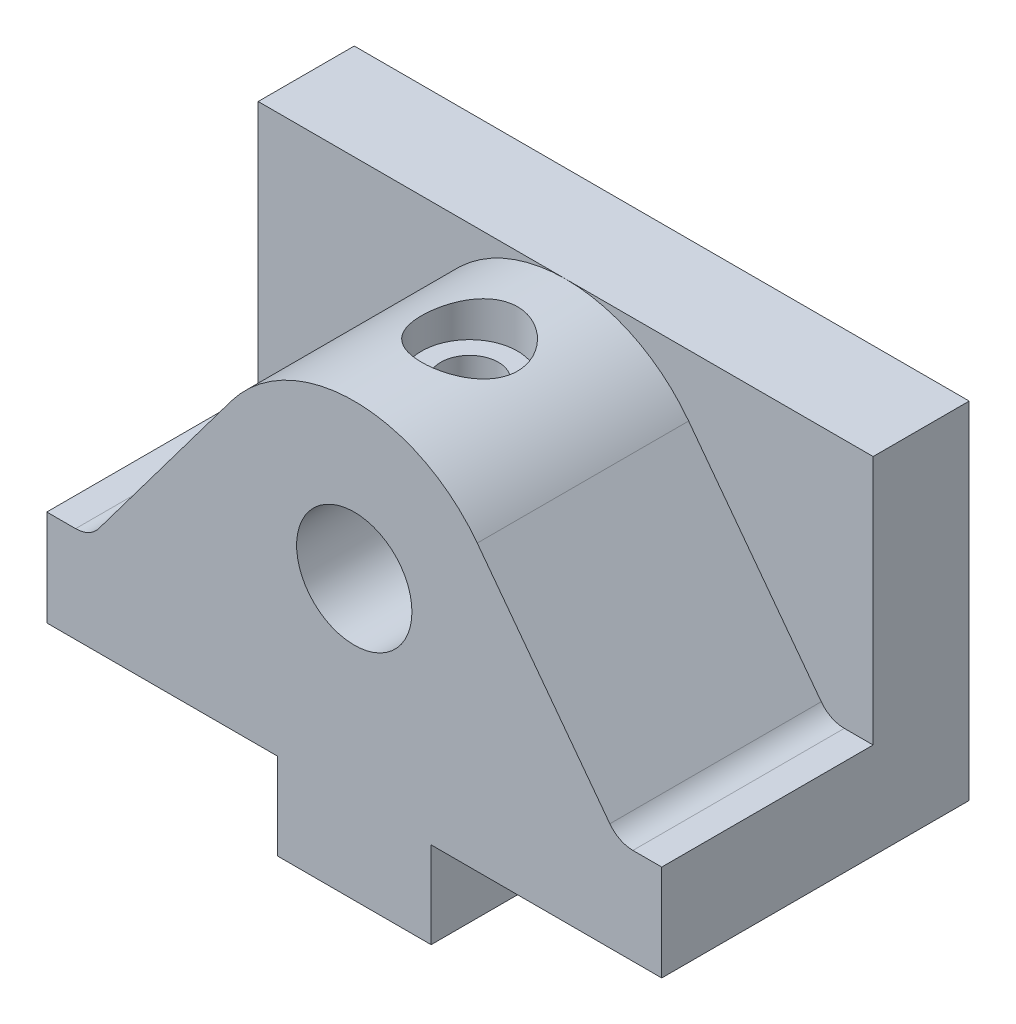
ISO-10303-21;
HEADER;
FILE_DESCRIPTION(('STEP AP214'),'2;1');
FILE_NAME('part.step','',(''),(''),'','','');
FILE_SCHEMA(('AUTOMOTIVE_DESIGN { 1 0 10303 214 1 1 1 1 }'));
ENDSEC;
DATA;
#1=APPLICATION_CONTEXT('core data for automotive mechanical design processes');
#2=APPLICATION_PROTOCOL_DEFINITION('international standard','automotive_design',2000,#1);
#3=PRODUCT_CONTEXT('',#1,'mechanical');
#4=PRODUCT('Part','Part','',(#3));
#5=PRODUCT_RELATED_PRODUCT_CATEGORY('part','',(#4));
#6=PRODUCT_DEFINITION_FORMATION('','',#4);
#7=PRODUCT_DEFINITION_CONTEXT('part definition',#1,'design');
#8=PRODUCT_DEFINITION('design','',#6,#7);
#9=PRODUCT_DEFINITION_SHAPE('','',#8);
#10=(LENGTH_UNIT() NAMED_UNIT(*) SI_UNIT(.MILLI.,.METRE.));
#11=(NAMED_UNIT(*) PLANE_ANGLE_UNIT() SI_UNIT($,.RADIAN.));
#12=(NAMED_UNIT(*) SI_UNIT($,.STERADIAN.) SOLID_ANGLE_UNIT());
#13=UNCERTAINTY_MEASURE_WITH_UNIT(LENGTH_MEASURE(1.E-05),#10,'distance_accuracy_value','');
#14=(GEOMETRIC_REPRESENTATION_CONTEXT(3) GLOBAL_UNCERTAINTY_ASSIGNED_CONTEXT((#13)) GLOBAL_UNIT_ASSIGNED_CONTEXT((#10,
#11,#12)) REPRESENTATION_CONTEXT('',''));
#15=CARTESIAN_POINT('',(0.,0.,0.));
#16=DIRECTION('',(0.,0.,1.));
#17=DIRECTION('',(1.,0.,0.));
#18=AXIS2_PLACEMENT_3D('',#15,#16,#17);
#19=CARTESIAN_POINT('',(8.00000000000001,-23.,32.));
#20=DIRECTION('',(0.,1.,0.));
#21=DIRECTION('',(-1.,0.,0.));
#22=AXIS2_PLACEMENT_3D('',#19,#20,#21);
#23=PLANE('',#22);
#24=CARTESIAN_POINT('',(0.,-23.,24.));
#25=DIRECTION('',(0.,1.,0.));
#26=DIRECTION('',(-1.,0.,0.));
#27=AXIS2_PLACEMENT_3D('',#24,#25,#26);
#28=CIRCLE('',#27,3.);
#29=CARTESIAN_POINT('',(-2.99999999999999,-23.,24.));
#30=VERTEX_POINT('',#29);
#31=EDGE_CURVE('E179',#30,#30,#28,.T.);
#32=ORIENTED_EDGE('',*,*,#31,.T.);
#33=EDGE_LOOP('',(#32));
#34=FACE_BOUND('',#33,.T.);
#35=DIRECTION('',(1.,0.,0.));
#36=VECTOR('',#35,1.);
#37=CARTESIAN_POINT('',(8.00000000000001,-23.,0.));
#38=LINE('',#37,#36);
#39=CARTESIAN_POINT('',(-7.99999999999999,-23.,0.));
#40=VERTEX_POINT('',#39);
#41=CARTESIAN_POINT('',(8.00000000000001,-23.,0.));
#42=VERTEX_POINT('',#41);
#43=EDGE_CURVE('E358',#40,#42,#38,.T.);
#44=ORIENTED_EDGE('',*,*,#43,.T.);
#45=DIRECTION('',(0.,0.,-1.));
#46=VECTOR('',#45,1.);
#47=CARTESIAN_POINT('',(8.00000000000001,-23.,32.));
#48=LINE('',#47,#46);
#49=CARTESIAN_POINT('',(8.00000000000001,-23.,32.));
#50=VERTEX_POINT('',#49);
#51=EDGE_CURVE('E385',#50,#42,#48,.T.);
#52=ORIENTED_EDGE('',*,*,#51,.F.);
#53=DIRECTION('',(1.,0.,0.));
#54=VECTOR('',#53,1.);
#55=CARTESIAN_POINT('',(8.00000000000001,-23.,32.));
#56=LINE('',#55,#54);
#57=CARTESIAN_POINT('',(-7.99999999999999,-23.,32.));
#58=VERTEX_POINT('',#57);
#59=EDGE_CURVE('E373',#58,#50,#56,.T.);
#60=ORIENTED_EDGE('',*,*,#59,.F.);
#61=DIRECTION('',(0.,0.,-1.));
#62=VECTOR('',#61,1.);
#63=CARTESIAN_POINT('',(-7.99999999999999,-23.,32.));
#64=LINE('',#63,#62);
#65=EDGE_CURVE('E388',#58,#40,#64,.T.);
#66=ORIENTED_EDGE('',*,*,#65,.T.);
#67=EDGE_LOOP('',(#44,#52,#60,#66));
#68=FACE_BOUND('',#67,.T.);
#69=CARTESIAN_POINT('',(0.,-23.,8.));
#70=DIRECTION('',(0.,1.,0.));
#71=DIRECTION('',(-1.,0.,0.));
#72=AXIS2_PLACEMENT_3D('',#69,#70,#71);
#73=CIRCLE('',#72,3.);
#74=CARTESIAN_POINT('',(-2.99999999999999,-23.,8.));
#75=VERTEX_POINT('',#74);
#76=EDGE_CURVE('E171',#75,#75,#73,.T.);
#77=ORIENTED_EDGE('',*,*,#76,.T.);
#78=EDGE_LOOP('',(#77));
#79=FACE_BOUND('',#78,.T.);
#80=ADVANCED_FACE('F32',(#34,#68,#79),#23,.F.);
#81=CARTESIAN_POINT('',(32.,22.,32.));
#82=DIRECTION('',(-1.,0.,0.));
#83=DIRECTION('',(0.,-1.,0.));
#84=AXIS2_PLACEMENT_3D('',#81,#82,#83);
#85=PLANE('',#84);
#86=DIRECTION('',(0.,-1.,0.));
#87=VECTOR('',#86,1.);
#88=CARTESIAN_POINT('',(32.,22.,10.));
#89=LINE('',#88,#87);
#90=CARTESIAN_POINT('',(32.,22.,10.));
#91=VERTEX_POINT('',#90);
#92=CARTESIAN_POINT('',(32.,-4.,10.));
#93=VERTEX_POINT('',#92);
#94=EDGE_CURVE('E345',#91,#93,#89,.T.);
#95=ORIENTED_EDGE('',*,*,#94,.T.);
#96=DIRECTION('',(0.,0.,1.));
#97=VECTOR('',#96,1.);
#98=CARTESIAN_POINT('',(32.,-4.,32.));
#99=LINE('',#98,#97);
#100=CARTESIAN_POINT('',(32.,-4.,32.));
#101=VERTEX_POINT('',#100);
#102=EDGE_CURVE('E336',#93,#101,#99,.T.);
#103=ORIENTED_EDGE('',*,*,#102,.T.);
#104=DIRECTION('',(0.,1.,0.));
#105=VECTOR('',#104,1.);
#106=CARTESIAN_POINT('',(32.,22.,32.));
#107=LINE('',#106,#105);
#108=CARTESIAN_POINT('',(32.,-14.,32.));
#109=VERTEX_POINT('',#108);
#110=EDGE_CURVE('E364',#109,#101,#107,.T.);
#111=ORIENTED_EDGE('',*,*,#110,.F.);
#112=DIRECTION('',(0.,0.,-1.));
#113=VECTOR('',#112,1.);
#114=CARTESIAN_POINT('',(32.,-14.,32.));
#115=LINE('',#114,#113);
#116=CARTESIAN_POINT('',(32.,-14.,0.));
#117=VERTEX_POINT('',#116);
#118=EDGE_CURVE('E379',#109,#117,#115,.T.);
#119=ORIENTED_EDGE('',*,*,#118,.T.);
#120=DIRECTION('',(0.,1.,0.));
#121=VECTOR('',#120,1.);
#122=CARTESIAN_POINT('',(32.,22.,0.));
#123=LINE('',#122,#121);
#124=CARTESIAN_POINT('',(32.,22.,0.));
#125=VERTEX_POINT('',#124);
#126=EDGE_CURVE('E348',#117,#125,#123,.T.);
#127=ORIENTED_EDGE('',*,*,#126,.T.);
#128=DIRECTION('',(0.,0.,-1.));
#129=VECTOR('',#128,1.);
#130=CARTESIAN_POINT('',(32.,22.,32.));
#131=LINE('',#130,#129);
#132=EDGE_CURVE('E263',#91,#125,#131,.T.);
#133=ORIENTED_EDGE('',*,*,#132,.F.);
#134=EDGE_LOOP('',(#95,#103,#111,#119,#127,#133));
#135=FACE_BOUND('',#134,.T.);
#136=ADVANCED_FACE('F34',(#135),#85,.F.);
#137=CARTESIAN_POINT('',(-32.,22.,32.));
#138=DIRECTION('',(0.,-1.,0.));
#139=DIRECTION('',(1.,0.,0.));
#140=AXIS2_PLACEMENT_3D('',#137,#138,#139);
#141=PLANE('',#140);
#142=DIRECTION('',(0.,0.,-1.));
#143=VECTOR('',#142,1.);
#144=CARTESIAN_POINT('',(-32.,22.,32.));
#145=LINE('',#144,#143);
#146=CARTESIAN_POINT('',(-32.,22.,10.));
#147=VERTEX_POINT('',#146);
#148=CARTESIAN_POINT('',(-32.,22.,0.));
#149=VERTEX_POINT('',#148);
#150=EDGE_CURVE('E256',#147,#149,#145,.T.);
#151=ORIENTED_EDGE('',*,*,#150,.F.);
#152=DIRECTION('',(1.,0.,0.));
#153=VECTOR('',#152,1.);
#154=CARTESIAN_POINT('',(-32.,22.,10.));
#155=LINE('',#154,#153);
#156=CARTESIAN_POINT('',(0.,22.,10.));
#157=VERTEX_POINT('',#156);
#158=EDGE_CURVE('E258',#147,#157,#155,.T.);
#159=ORIENTED_EDGE('',*,*,#158,.T.);
#160=EDGE_CURVE('E344',#157,#91,#155,.T.);
#161=ORIENTED_EDGE('',*,*,#160,.T.);
#162=ORIENTED_EDGE('',*,*,#132,.T.);
#163=DIRECTION('',(-1.,0.,0.));
#164=VECTOR('',#163,1.);
#165=CARTESIAN_POINT('',(-32.,22.,0.));
#166=LINE('',#165,#164);
#167=EDGE_CURVE('E260',#125,#149,#166,.T.);
#168=ORIENTED_EDGE('',*,*,#167,.T.);
#169=EDGE_LOOP('',(#151,#159,#161,#162,#168));
#170=FACE_BOUND('',#169,.T.);
#171=ADVANCED_FACE('F231',(#170),#141,.F.);
#172=CARTESIAN_POINT('',(-32.,22.,32.));
#173=DIRECTION('',(1.,0.,0.));
#174=DIRECTION('',(0.,1.,0.));
#175=AXIS2_PLACEMENT_3D('',#172,#173,#174);
#176=PLANE('',#175);
#177=DIRECTION('',(0.,-1.,0.));
#178=VECTOR('',#177,1.);
#179=CARTESIAN_POINT('',(-32.,22.,32.));
#180=LINE('',#179,#178);
#181=CARTESIAN_POINT('',(-32.,-4.,32.));
#182=VERTEX_POINT('',#181);
#183=CARTESIAN_POINT('',(-32.,-14.,32.));
#184=VERTEX_POINT('',#183);
#185=EDGE_CURVE('E367',#182,#184,#180,.T.);
#186=ORIENTED_EDGE('',*,*,#185,.F.);
#187=DIRECTION('',(0.,0.,-1.));
#188=VECTOR('',#187,1.);
#189=CARTESIAN_POINT('',(-32.,-4.,32.));
#190=LINE('',#189,#188);
#191=CARTESIAN_POINT('',(-32.,-4.,10.));
#192=VERTEX_POINT('',#191);
#193=EDGE_CURVE('E340',#182,#192,#190,.T.);
#194=ORIENTED_EDGE('',*,*,#193,.T.);
#195=DIRECTION('',(0.,1.,0.));
#196=VECTOR('',#195,1.);
#197=CARTESIAN_POINT('',(-32.,22.,10.));
#198=LINE('',#197,#196);
#199=EDGE_CURVE('E277',#192,#147,#198,.T.);
#200=ORIENTED_EDGE('',*,*,#199,.T.);
#201=ORIENTED_EDGE('',*,*,#150,.T.);
#202=DIRECTION('',(0.,-1.,0.));
#203=VECTOR('',#202,1.);
#204=CARTESIAN_POINT('',(-32.,22.,0.));
#205=LINE('',#204,#203);
#206=CARTESIAN_POINT('',(-32.,-14.,0.));
#207=VERTEX_POINT('',#206);
#208=EDGE_CURVE('E352',#149,#207,#205,.T.);
#209=ORIENTED_EDGE('',*,*,#208,.T.);
#210=DIRECTION('',(0.,0.,-1.));
#211=VECTOR('',#210,1.);
#212=CARTESIAN_POINT('',(-32.,-14.,32.));
#213=LINE('',#212,#211);
#214=EDGE_CURVE('E264',#184,#207,#213,.T.);
#215=ORIENTED_EDGE('',*,*,#214,.F.);
#216=EDGE_LOOP('',(#186,#194,#200,#201,#209,#215));
#217=FACE_BOUND('',#216,.T.);
#218=ADVANCED_FACE('F245',(#217),#176,.F.);
#219=CARTESIAN_POINT('',(-32.,-14.,32.));
#220=DIRECTION('',(0.,1.,0.));
#221=DIRECTION('',(-1.,0.,0.));
#222=AXIS2_PLACEMENT_3D('',#219,#220,#221);
#223=PLANE('',#222);
#224=DIRECTION('',(1.,0.,0.));
#225=VECTOR('',#224,1.);
#226=CARTESIAN_POINT('',(-32.,-14.,0.));
#227=LINE('',#226,#225);
#228=CARTESIAN_POINT('',(-7.99999999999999,-14.,0.));
#229=VERTEX_POINT('',#228);
#230=EDGE_CURVE('E354',#207,#229,#227,.T.);
#231=ORIENTED_EDGE('',*,*,#230,.T.);
#232=DIRECTION('',(0.,0.,-1.));
#233=VECTOR('',#232,1.);
#234=CARTESIAN_POINT('',(-7.99999999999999,-14.,32.));
#235=LINE('',#234,#233);
#236=CARTESIAN_POINT('',(-7.99999999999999,-14.,32.));
#237=VERTEX_POINT('',#236);
#238=EDGE_CURVE('E269',#237,#229,#235,.T.);
#239=ORIENTED_EDGE('',*,*,#238,.F.);
#240=DIRECTION('',(1.,0.,0.));
#241=VECTOR('',#240,1.);
#242=CARTESIAN_POINT('',(-32.,-14.,32.));
#243=LINE('',#242,#241);
#244=EDGE_CURVE('E369',#184,#237,#243,.T.);
#245=ORIENTED_EDGE('',*,*,#244,.F.);
#246=ORIENTED_EDGE('',*,*,#214,.T.);
#247=EDGE_LOOP('',(#231,#239,#245,#246));
#248=FACE_BOUND('',#247,.T.);
#249=ADVANCED_FACE('F241',(#248),#223,.F.);
#250=CARTESIAN_POINT('',(-7.99999999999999,-14.,32.));
#251=DIRECTION('',(1.,0.,0.));
#252=DIRECTION('',(0.,1.,0.));
#253=AXIS2_PLACEMENT_3D('',#250,#251,#252);
#254=PLANE('',#253);
#255=DIRECTION('',(0.,-1.,0.));
#256=VECTOR('',#255,1.);
#257=CARTESIAN_POINT('',(-7.99999999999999,-14.,0.));
#258=LINE('',#257,#256);
#259=EDGE_CURVE('E356',#229,#40,#258,.T.);
#260=ORIENTED_EDGE('',*,*,#259,.T.);
#261=ORIENTED_EDGE('',*,*,#65,.F.);
#262=DIRECTION('',(0.,-1.,0.));
#263=VECTOR('',#262,1.);
#264=CARTESIAN_POINT('',(-7.99999999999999,-14.,32.));
#265=LINE('',#264,#263);
#266=EDGE_CURVE('E371',#237,#58,#265,.T.);
#267=ORIENTED_EDGE('',*,*,#266,.F.);
#268=ORIENTED_EDGE('',*,*,#238,.T.);
#269=EDGE_LOOP('',(#260,#261,#267,#268));
#270=FACE_BOUND('',#269,.T.);
#271=ADVANCED_FACE('F238',(#270),#254,.F.);
#272=CARTESIAN_POINT('',(8.00000000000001,-14.,32.));
#273=DIRECTION('',(-1.,0.,0.));
#274=DIRECTION('',(0.,-1.,0.));
#275=AXIS2_PLACEMENT_3D('',#272,#273,#274);
#276=PLANE('',#275);
#277=DIRECTION('',(0.,1.,0.));
#278=VECTOR('',#277,1.);
#279=CARTESIAN_POINT('',(8.00000000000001,-14.,0.));
#280=LINE('',#279,#278);
#281=CARTESIAN_POINT('',(8.00000000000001,-14.,0.));
#282=VERTEX_POINT('',#281);
#283=EDGE_CURVE('E360',#42,#282,#280,.T.);
#284=ORIENTED_EDGE('',*,*,#283,.T.);
#285=DIRECTION('',(0.,0.,-1.));
#286=VECTOR('',#285,1.);
#287=CARTESIAN_POINT('',(8.00000000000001,-14.,32.));
#288=LINE('',#287,#286);
#289=CARTESIAN_POINT('',(8.00000000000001,-14.,32.));
#290=VERTEX_POINT('',#289);
#291=EDGE_CURVE('E382',#290,#282,#288,.T.);
#292=ORIENTED_EDGE('',*,*,#291,.F.);
#293=DIRECTION('',(0.,1.,0.));
#294=VECTOR('',#293,1.);
#295=CARTESIAN_POINT('',(8.00000000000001,-14.,32.));
#296=LINE('',#295,#294);
#297=EDGE_CURVE('E375',#50,#290,#296,.T.);
#298=ORIENTED_EDGE('',*,*,#297,.F.);
#299=ORIENTED_EDGE('',*,*,#51,.T.);
#300=EDGE_LOOP('',(#284,#292,#298,#299));
#301=FACE_BOUND('',#300,.T.);
#302=ADVANCED_FACE('F236',(#301),#276,.F.);
#303=CARTESIAN_POINT('',(32.,-14.,32.));
#304=DIRECTION('',(0.,1.,0.));
#305=DIRECTION('',(-1.,0.,0.));
#306=AXIS2_PLACEMENT_3D('',#303,#304,#305);
#307=PLANE('',#306);
#308=DIRECTION('',(1.,0.,0.));
#309=VECTOR('',#308,1.);
#310=CARTESIAN_POINT('',(32.,-14.,0.));
#311=LINE('',#310,#309);
#312=EDGE_CURVE('E362',#282,#117,#311,.T.);
#313=ORIENTED_EDGE('',*,*,#312,.T.);
#314=ORIENTED_EDGE('',*,*,#118,.F.);
#315=DIRECTION('',(1.,0.,0.));
#316=VECTOR('',#315,1.);
#317=CARTESIAN_POINT('',(32.,-14.,32.));
#318=LINE('',#317,#316);
#319=EDGE_CURVE('E377',#290,#109,#318,.T.);
#320=ORIENTED_EDGE('',*,*,#319,.F.);
#321=ORIENTED_EDGE('',*,*,#291,.T.);
#322=EDGE_LOOP('',(#313,#314,#320,#321));
#323=FACE_BOUND('',#322,.T.);
#324=ADVANCED_FACE('F416',(#323),#307,.F.);
#325=CARTESIAN_POINT('',(32.,-23.,32.));
#326=DIRECTION('',(0.,0.,-1.));
#327=DIRECTION('',(-1.,0.,0.));
#328=AXIS2_PLACEMENT_3D('',#325,#326,#327);
#329=PLANE('',#328);
#330=CARTESIAN_POINT('',(0.,6.,32.));
#331=DIRECTION('',(0.,0.,1.));
#332=DIRECTION('',(1.,0.,0.));
#333=AXIS2_PLACEMENT_3D('',#330,#331,#332);
#334=CIRCLE('',#333,6.);
#335=CARTESIAN_POINT('',(6.,6.,32.));
#336=VERTEX_POINT('',#335);
#337=EDGE_CURVE('E195',#336,#336,#334,.T.);
#338=ORIENTED_EDGE('',*,*,#337,.F.);
#339=EDGE_LOOP('',(#338));
#340=FACE_BOUND('',#339,.T.);
#341=DIRECTION('',(0.6,0.8,0.));
#342=VECTOR('',#341,1.);
#343=CARTESIAN_POINT('',(-12.8,15.6,32.));
#344=LINE('',#343,#342);
#345=CARTESIAN_POINT('',(-26.6,-2.80000000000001,32.));
#346=VERTEX_POINT('',#345);
#347=CARTESIAN_POINT('',(-12.8,15.6,32.));
#348=VERTEX_POINT('',#347);
#349=EDGE_CURVE('E317',#346,#348,#344,.T.);
#350=ORIENTED_EDGE('',*,*,#349,.F.);
#351=CARTESIAN_POINT('',(-29.,-1.00000000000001,32.));
#352=DIRECTION('',(0.,0.,-1.));
#353=DIRECTION('',(-1.,0.,0.));
#354=AXIS2_PLACEMENT_3D('',#351,#352,#353);
#355=CIRCLE('',#354,3.);
#356=CARTESIAN_POINT('',(-29.,-4.00000000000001,32.));
#357=VERTEX_POINT('',#356);
#358=EDGE_CURVE('E292',#346,#357,#355,.T.);
#359=ORIENTED_EDGE('',*,*,#358,.T.);
#360=DIRECTION('',(-1.,0.,0.));
#361=VECTOR('',#360,1.);
#362=CARTESIAN_POINT('',(32.,-4.00000000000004,32.));
#363=LINE('',#362,#361);
#364=EDGE_CURVE('E275',#357,#182,#363,.T.);
#365=ORIENTED_EDGE('',*,*,#364,.T.);
#366=ORIENTED_EDGE('',*,*,#185,.T.);
#367=ORIENTED_EDGE('',*,*,#244,.T.);
#368=ORIENTED_EDGE('',*,*,#266,.T.);
#369=ORIENTED_EDGE('',*,*,#59,.T.);
#370=ORIENTED_EDGE('',*,*,#297,.T.);
#371=ORIENTED_EDGE('',*,*,#319,.T.);
#372=ORIENTED_EDGE('',*,*,#110,.T.);
#373=DIRECTION('',(1.,0.,0.));
#374=VECTOR('',#373,1.);
#375=CARTESIAN_POINT('',(38.9732794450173,-4.,32.));
#376=LINE('',#375,#374);
#377=CARTESIAN_POINT('',(29.,-4.,32.));
#378=VERTEX_POINT('',#377);
#379=EDGE_CURVE('E314',#378,#101,#376,.T.);
#380=ORIENTED_EDGE('',*,*,#379,.F.);
#381=CARTESIAN_POINT('',(29.,-0.999999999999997,32.));
#382=DIRECTION('',(0.,0.,-1.));
#383=DIRECTION('',(-1.,0.,0.));
#384=AXIS2_PLACEMENT_3D('',#381,#382,#383);
#385=CIRCLE('',#384,3.);
#386=CARTESIAN_POINT('',(26.6,-2.8,32.));
#387=VERTEX_POINT('',#386);
#388=EDGE_CURVE('E293',#378,#387,#385,.T.);
#389=ORIENTED_EDGE('',*,*,#388,.T.);
#390=DIRECTION('',(0.6,-0.8,0.));
#391=VECTOR('',#390,1.);
#392=CARTESIAN_POINT('',(12.8,15.6,32.));
#393=LINE('',#392,#391);
#394=CARTESIAN_POINT('',(12.8,15.6,32.));
#395=VERTEX_POINT('',#394);
#396=EDGE_CURVE('E312',#395,#387,#393,.T.);
#397=ORIENTED_EDGE('',*,*,#396,.F.);
#398=CARTESIAN_POINT('',(0.,6.,32.));
#399=DIRECTION('',(0.,0.,-1.));
#400=DIRECTION('',(-1.,0.,0.));
#401=AXIS2_PLACEMENT_3D('',#398,#399,#400);
#402=CIRCLE('',#401,16.);
#403=EDGE_CURVE('E266',#395,#348,#402,.F.);
#404=ORIENTED_EDGE('',*,*,#403,.T.);
#405=EDGE_LOOP('',(#350,#359,#365,#366,#367,#368,#369,#370,#371,#372,#380,#389,#397,#404));
#406=FACE_BOUND('',#405,.T.);
#407=ADVANCED_FACE('F313',(#340,#406),#329,.F.);
#408=CARTESIAN_POINT('',(32.,-23.,0.));
#409=DIRECTION('',(0.,0.,-1.));
#410=DIRECTION('',(-1.,0.,0.));
#411=AXIS2_PLACEMENT_3D('',#408,#409,#410);
#412=PLANE('',#411);
#413=ORIENTED_EDGE('',*,*,#126,.F.);
#414=ORIENTED_EDGE('',*,*,#312,.F.);
#415=ORIENTED_EDGE('',*,*,#283,.F.);
#416=ORIENTED_EDGE('',*,*,#43,.F.);
#417=ORIENTED_EDGE('',*,*,#259,.F.);
#418=ORIENTED_EDGE('',*,*,#230,.F.);
#419=ORIENTED_EDGE('',*,*,#208,.F.);
#420=ORIENTED_EDGE('',*,*,#167,.F.);
#421=EDGE_LOOP('',(#413,#414,#415,#416,#417,#418,#419,#420));
#422=FACE_BOUND('',#421,.T.);
#423=ADVANCED_FACE('F400',(#422),#412,.T.);
#424=CARTESIAN_POINT('',(0.,6.,10.));
#425=DIRECTION('',(0.,0.,-1.));
#426=DIRECTION('',(-1.,0.,0.));
#427=AXIS2_PLACEMENT_3D('',#424,#425,#426);
#428=PLANE('',#427);
#429=DIRECTION('',(0.6,-0.8,0.));
#430=VECTOR('',#429,1.);
#431=CARTESIAN_POINT('',(12.8,15.6,10.));
#432=LINE('',#431,#430);
#433=CARTESIAN_POINT('',(12.8,15.6,10.));
#434=VERTEX_POINT('',#433);
#435=CARTESIAN_POINT('',(26.6,-2.8,10.));
#436=VERTEX_POINT('',#435);
#437=EDGE_CURVE('E326',#434,#436,#432,.T.);
#438=ORIENTED_EDGE('',*,*,#437,.T.);
#439=CARTESIAN_POINT('',(29.,-0.999999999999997,10.));
#440=DIRECTION('',(0.,0.,-1.));
#441=DIRECTION('',(-1.,0.,0.));
#442=AXIS2_PLACEMENT_3D('',#439,#440,#441);
#443=CIRCLE('',#442,3.);
#444=CARTESIAN_POINT('',(29.,-4.,10.));
#445=VERTEX_POINT('',#444);
#446=EDGE_CURVE('E290',#436,#445,#443,.F.);
#447=ORIENTED_EDGE('',*,*,#446,.T.);
#448=DIRECTION('',(1.,0.,0.));
#449=VECTOR('',#448,1.);
#450=CARTESIAN_POINT('',(27.5,-4.,10.));
#451=LINE('',#450,#449);
#452=EDGE_CURVE('E328',#445,#93,#451,.T.);
#453=ORIENTED_EDGE('',*,*,#452,.T.);
#454=ORIENTED_EDGE('',*,*,#94,.F.);
#455=ORIENTED_EDGE('',*,*,#160,.F.);
#456=CARTESIAN_POINT('',(0.,6.,10.));
#457=DIRECTION('',(0.,0.,-1.));
#458=DIRECTION('',(-1.,0.,0.));
#459=AXIS2_PLACEMENT_3D('',#456,#457,#458);
#460=CIRCLE('',#459,16.);
#461=EDGE_CURVE('E322',#157,#434,#460,.T.);
#462=ORIENTED_EDGE('',*,*,#461,.T.);
#463=EDGE_LOOP('',(#438,#447,#453,#454,#455,#462));
#464=FACE_BOUND('',#463,.T.);
#465=ADVANCED_FACE('F426',(#464),#428,.F.);
#466=DIRECTION('',(1.,0.,0.));
#467=VECTOR('',#466,1.);
#468=CARTESIAN_POINT('',(-32.,-4.,10.));
#469=LINE('',#468,#467);
#470=CARTESIAN_POINT('',(-29.,-4.,10.));
#471=VERTEX_POINT('',#470);
#472=EDGE_CURVE('E330',#192,#471,#469,.T.);
#473=ORIENTED_EDGE('',*,*,#472,.T.);
#474=CARTESIAN_POINT('',(-29.,-1.00000000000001,10.));
#475=DIRECTION('',(0.,0.,-1.));
#476=DIRECTION('',(-1.,0.,0.));
#477=AXIS2_PLACEMENT_3D('',#474,#475,#476);
#478=CIRCLE('',#477,3.);
#479=CARTESIAN_POINT('',(-26.6,-2.80000000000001,10.));
#480=VERTEX_POINT('',#479);
#481=EDGE_CURVE('E284',#471,#480,#478,.F.);
#482=ORIENTED_EDGE('',*,*,#481,.T.);
#483=DIRECTION('',(0.6,0.8,0.));
#484=VECTOR('',#483,1.);
#485=CARTESIAN_POINT('',(-12.8,15.6,10.));
#486=LINE('',#485,#484);
#487=CARTESIAN_POINT('',(-12.8,15.6,10.));
#488=VERTEX_POINT('',#487);
#489=EDGE_CURVE('E333',#480,#488,#486,.T.);
#490=ORIENTED_EDGE('',*,*,#489,.T.);
#491=EDGE_CURVE('E323',#488,#157,#460,.T.);
#492=ORIENTED_EDGE('',*,*,#491,.T.);
#493=ORIENTED_EDGE('',*,*,#158,.F.);
#494=ORIENTED_EDGE('',*,*,#199,.F.);
#495=EDGE_LOOP('',(#473,#482,#490,#492,#493,#494));
#496=FACE_BOUND('',#495,.T.);
#497=ADVANCED_FACE('F302',(#496),#428,.F.);
#498=CARTESIAN_POINT('',(0.,6.,10.));
#499=DIRECTION('',(0.,0.,1.));
#500=DIRECTION('',(1.,0.,0.));
#501=AXIS2_PLACEMENT_3D('',#498,#499,#500);
#502=CYLINDRICAL_SURFACE('',#501,16.);
#503=CARTESIAN_POINT('',(0.,22.,25.));
#504=CARTESIAN_POINT('',(-0.273756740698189,21.9999986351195,24.9999982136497));
#505=CARTESIAN_POINT('',(-0.54753221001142,21.9929077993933,24.9774430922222));
#506=CARTESIAN_POINT('',(-1.08707683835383,21.9653157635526,24.888055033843));
#507=CARTESIAN_POINT('',(-1.35284417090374,21.9448115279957,24.8212120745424));
#508=CARTESIAN_POINT('',(-1.86851417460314,21.892632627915,24.6457225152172));
#509=CARTESIAN_POINT('',(-2.11844070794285,21.860975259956,24.5371406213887));
#510=CARTESIAN_POINT('',(-2.59653920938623,21.7897587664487,24.2815307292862));
#511=CARTESIAN_POINT('',(-2.82470774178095,21.7501983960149,24.1344966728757));
#512=CARTESIAN_POINT('',(-3.25986133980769,21.6660085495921,23.8013760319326));
#513=CARTESIAN_POINT('',(-3.4660801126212,21.621268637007,23.6143164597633));
#514=CARTESIAN_POINT('',(-3.84478952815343,21.5324018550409,23.2085264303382));
#515=CARTESIAN_POINT('',(-4.01727389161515,21.4882751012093,22.9897900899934));
#516=CARTESIAN_POINT('',(-4.32777345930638,21.4044457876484,22.5202217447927));
#517=CARTESIAN_POINT('',(-4.46483136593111,21.3648795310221,22.2687300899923));
#518=CARTESIAN_POINT('',(-4.69438964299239,21.2963120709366,21.7448307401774));
#519=CARTESIAN_POINT('',(-4.78690175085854,21.2673080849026,21.4724285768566));
#520=CARTESIAN_POINT('',(-4.92193839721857,21.224304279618,20.9230876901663));
#521=CARTESIAN_POINT('',(-4.96588440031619,21.2098789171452,20.6465326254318));
#522=CARTESIAN_POINT('',(-5.00698220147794,21.1964022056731,20.0896275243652));
#523=CARTESIAN_POINT('',(-5.00414643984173,21.1973467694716,19.809278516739));
#524=CARTESIAN_POINT('',(-4.95287298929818,21.2141275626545,19.2645021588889));
#525=CARTESIAN_POINT('',(-4.90624231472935,21.2293736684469,18.9998834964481));
#526=CARTESIAN_POINT('',(-4.77163253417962,21.272081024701,18.482431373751));
#527=CARTESIAN_POINT('',(-4.68364903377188,21.2995435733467,18.2295991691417));
#528=CARTESIAN_POINT('',(-4.46755498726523,21.3640417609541,17.7385922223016));
#529=CARTESIAN_POINT('',(-4.33887702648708,21.4012113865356,17.5006855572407));
#530=CARTESIAN_POINT('',(-4.04544082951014,21.4808742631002,17.0492489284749));
#531=CARTESIAN_POINT('',(-3.88067322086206,21.523368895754,16.8357253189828));
#532=CARTESIAN_POINT('',(-3.51086781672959,21.6112611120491,16.4289002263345));
#533=CARTESIAN_POINT('',(-3.30433828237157,21.6567027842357,16.2369617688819));
#534=CARTESIAN_POINT('',(-2.86145763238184,21.7436628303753,15.8901124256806));
#535=CARTESIAN_POINT('',(-2.62510430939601,21.7851809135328,15.735204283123));
#536=CARTESIAN_POINT('',(-2.12665844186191,21.8600517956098,15.4658892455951));
#537=CARTESIAN_POINT('',(-1.86437962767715,21.8933384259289,15.3518074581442));
#538=CARTESIAN_POINT('',(-1.32307191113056,21.9475182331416,15.1697879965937));
#539=CARTESIAN_POINT('',(-1.04404812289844,21.9684151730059,15.1018363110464));
#540=CARTESIAN_POINT('',(-0.488740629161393,21.9948555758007,15.0163278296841));
#541=CARTESIAN_POINT('',(-0.212767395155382,22.0009609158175,14.9969258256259));
#542=CARTESIAN_POINT('',(0.338521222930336,21.9987919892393,15.0038649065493));
#543=CARTESIAN_POINT('',(0.613836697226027,21.9905198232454,15.0301993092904));
#544=CARTESIAN_POINT('',(1.14887733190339,21.9608945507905,15.1263823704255));
#545=CARTESIAN_POINT('',(1.40881991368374,21.9398717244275,15.1951330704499));
#546=CARTESIAN_POINT('',(1.9134077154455,21.8872048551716,15.3728574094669));
#547=CARTESIAN_POINT('',(2.15805104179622,21.8555595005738,15.4818360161));
#548=CARTESIAN_POINT('',(2.63172962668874,21.783941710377,15.7398928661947));
#549=CARTESIAN_POINT('',(2.86023895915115,21.7437850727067,15.8898839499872));
#550=CARTESIAN_POINT('',(3.28946340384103,21.6597364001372,16.2246128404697));
#551=CARTESIAN_POINT('',(3.49017095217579,21.6158433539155,16.4093600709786));
#552=CARTESIAN_POINT('',(3.86634985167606,21.5270797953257,16.8170355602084));
#553=CARTESIAN_POINT('',(4.04050609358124,21.4822394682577,17.0411866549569));
#554=CARTESIAN_POINT('',(4.34885000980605,21.3984778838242,17.5165064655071));
#555=CARTESIAN_POINT('',(4.48303831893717,21.3595565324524,17.7676747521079));
#556=CARTESIAN_POINT('',(4.70680333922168,21.2924712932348,18.2893806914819));
#557=CARTESIAN_POINT('',(4.79655278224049,21.264265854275,18.5598385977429));
#558=CARTESIAN_POINT('',(4.9289157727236,21.2220468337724,19.1130899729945));
#559=CARTESIAN_POINT('',(4.97154725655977,21.2080278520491,19.3958787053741));
#560=CARTESIAN_POINT('',(5.00717624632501,21.1963317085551,19.9520163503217));
#561=CARTESIAN_POINT('',(5.00233118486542,21.1979441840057,20.2252138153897));
#562=CARTESIAN_POINT('',(4.94835272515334,21.2156036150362,20.7666983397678));
#563=CARTESIAN_POINT('',(4.89922139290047,21.2316498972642,21.0349856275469));
#564=CARTESIAN_POINT('',(4.75950919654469,21.2758725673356,21.5551761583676));
#565=CARTESIAN_POINT('',(4.66954569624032,21.3038679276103,21.8072617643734));
#566=CARTESIAN_POINT('',(4.45120909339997,21.3687881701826,22.292961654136));
#567=CARTESIAN_POINT('',(4.32282817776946,21.4057148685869,22.5265721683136));
#568=CARTESIAN_POINT('',(4.02542700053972,21.4861394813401,22.9785838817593));
#569=CARTESIAN_POINT('',(3.85501334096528,21.5298379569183,23.196032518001));
#570=CARTESIAN_POINT('',(3.48083598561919,21.6179599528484,23.599945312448));
#571=CARTESIAN_POINT('',(3.27706336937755,21.6623836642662,23.7864011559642));
#572=CARTESIAN_POINT('',(2.83394665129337,21.7486908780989,24.1291301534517));
#573=CARTESIAN_POINT('',(2.59365829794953,21.7904440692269,24.2842189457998));
#574=CARTESIAN_POINT('',(2.08911655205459,21.8650707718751,24.5515956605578));
#575=CARTESIAN_POINT('',(1.82487263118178,21.8979477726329,24.6639004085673));
#576=CARTESIAN_POINT('',(1.3029905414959,21.9488260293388,24.8343654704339));
#577=CARTESIAN_POINT('',(1.04668134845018,21.9678496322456,24.8962994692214));
#578=CARTESIAN_POINT('',(0.526919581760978,21.9934360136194,24.9791134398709));
#579=CARTESIAN_POINT('',(0.263468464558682,22.0000013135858,25.000001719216));
#580=CARTESIAN_POINT('',(0.,22.,25.));
#581=B_SPLINE_CURVE_WITH_KNOTS('',3,(#503,#504,#505,#506,#507,#508,#509,#510,#511,#512,#513,
#514,#515,#516,#517,#518,#519,#520,#521,#522,#523,#524,#525,#526,#527,#528,#529,#530,#531,#532,
#533,#534,#535,#536,#537,#538,#539,#540,#541,#542,#543,#544,#545,#546,#547,#548,#549,#550,#551,
#552,#553,#554,#555,#556,#557,#558,#559,#560,#561,#562,#563,#564,#565,#566,#567,#568,#569,#570,
#571,#572,#573,#574,#575,#576,#577,#578,#579,#580),.UNSPECIFIED.,.T.,.F.,(4,2,2,2,2,2,2,2,2,2,2,
2,2,2,2,2,2,2,2,2,2,2,2,2,2,2,2,2,2,2,2,2,2,2,2,2,2,2,4),(0.,0.82030179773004,1.64078929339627,
2.46000991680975,3.27935968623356,4.12151288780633,4.96382269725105,5.82695084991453,
6.68985145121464,7.52676600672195,8.36345801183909,9.16707669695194,9.97078079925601,
10.7862257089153,11.6018826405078,12.4546698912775,13.3075202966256,14.1670184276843,
15.0262553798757,15.852302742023,16.678229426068,17.4836250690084,18.2891202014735,
19.1142529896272,19.9396098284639,20.7976711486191,21.655718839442,22.5104046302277,
23.3647649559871,24.1804881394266,24.9961732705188,25.7999165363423,26.6038233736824,
27.4391805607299,28.274761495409,29.1376267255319,30.0001522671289,30.789785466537,
31.5792588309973),.UNSPECIFIED.);
#582=CARTESIAN_POINT('',(0.,22.,15.));
#583=VERTEX_POINT('',#582);
#584=CARTESIAN_POINT('',(0.,22.,25.));
#585=VERTEX_POINT('',#584);
#586=EDGE_CURVE('E36',#583,#585,#581,.T.);
#587=ORIENTED_EDGE('',*,*,#586,.T.);
#588=EDGE_CURVE('E11',#585,#583,#581,.T.);
#589=ORIENTED_EDGE('',*,*,#588,.T.);
#590=EDGE_LOOP('',(#587,#589));
#591=FACE_BOUND('',#590,.T.);
#592=ORIENTED_EDGE('',*,*,#403,.F.);
#593=DIRECTION('',(0.,0.,1.));
#594=VECTOR('',#593,1.);
#595=CARTESIAN_POINT('',(12.8,15.6,10.));
#596=LINE('',#595,#594);
#597=EDGE_CURVE('E307',#434,#395,#596,.T.);
#598=ORIENTED_EDGE('',*,*,#597,.F.);
#599=ORIENTED_EDGE('',*,*,#461,.F.);
#600=ORIENTED_EDGE('',*,*,#491,.F.);
#601=DIRECTION('',(0.,0.,1.));
#602=VECTOR('',#601,1.);
#603=CARTESIAN_POINT('',(-12.8,15.6,10.));
#604=LINE('',#603,#602);
#605=EDGE_CURVE('E310',#488,#348,#604,.T.);
#606=ORIENTED_EDGE('',*,*,#605,.T.);
#607=EDGE_LOOP('',(#592,#598,#599,#600,#606));
#608=FACE_BOUND('',#607,.T.);
#609=ADVANCED_FACE('F298',(#591,#608),#502,.T.);
#610=CARTESIAN_POINT('',(-27.5,-4.00000000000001,10.));
#611=DIRECTION('',(0.,-1.,0.));
#612=DIRECTION('',(1.,0.,0.));
#613=AXIS2_PLACEMENT_3D('',#610,#611,#612);
#614=PLANE('',#613);
#615=ORIENTED_EDGE('',*,*,#364,.F.);
#616=DIRECTION('',(0.,0.,1.));
#617=VECTOR('',#616,1.);
#618=CARTESIAN_POINT('',(-29.,-4.00000000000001,10.));
#619=LINE('',#618,#617);
#620=EDGE_CURVE('E282',#357,#471,#619,.F.);
#621=ORIENTED_EDGE('',*,*,#620,.T.);
#622=ORIENTED_EDGE('',*,*,#472,.F.);
#623=ORIENTED_EDGE('',*,*,#193,.F.);
#624=EDGE_LOOP('',(#615,#621,#622,#623));
#625=FACE_BOUND('',#624,.T.);
#626=ADVANCED_FACE('F301',(#625),#614,.F.);
#627=CARTESIAN_POINT('',(38.9732794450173,-4.,10.));
#628=DIRECTION('',(0.,-1.,0.));
#629=DIRECTION('',(0.,0.,-1.));
#630=AXIS2_PLACEMENT_3D('',#627,#628,#629);
#631=PLANE('',#630);
#632=ORIENTED_EDGE('',*,*,#452,.F.);
#633=DIRECTION('',(0.,0.,1.));
#634=VECTOR('',#633,1.);
#635=CARTESIAN_POINT('',(29.,-4.,32.));
#636=LINE('',#635,#634);
#637=EDGE_CURVE('E286',#445,#378,#636,.T.);
#638=ORIENTED_EDGE('',*,*,#637,.T.);
#639=ORIENTED_EDGE('',*,*,#379,.T.);
#640=ORIENTED_EDGE('',*,*,#102,.F.);
#641=EDGE_LOOP('',(#632,#638,#639,#640));
#642=FACE_BOUND('',#641,.T.);
#643=ADVANCED_FACE('F434',(#642),#631,.F.);
#644=CARTESIAN_POINT('',(-12.8,15.6,10.));
#645=DIRECTION('',(0.8,-0.6,0.));
#646=DIRECTION('',(0.6,0.8,0.));
#647=AXIS2_PLACEMENT_3D('',#644,#645,#646);
#648=PLANE('',#647);
#649=ORIENTED_EDGE('',*,*,#489,.F.);
#650=DIRECTION('',(0.,0.,1.));
#651=VECTOR('',#650,1.);
#652=CARTESIAN_POINT('',(-26.6,-2.80000000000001,32.));
#653=LINE('',#652,#651);
#654=EDGE_CURVE('E279',#480,#346,#653,.T.);
#655=ORIENTED_EDGE('',*,*,#654,.T.);
#656=ORIENTED_EDGE('',*,*,#349,.T.);
#657=ORIENTED_EDGE('',*,*,#605,.F.);
#658=EDGE_LOOP('',(#649,#655,#656,#657));
#659=FACE_BOUND('',#658,.T.);
#660=ADVANCED_FACE('F433',(#659),#648,.F.);
#661=CARTESIAN_POINT('',(12.8,15.6,10.));
#662=DIRECTION('',(-0.8,-0.6,0.));
#663=DIRECTION('',(0.6,-0.8,0.));
#664=AXIS2_PLACEMENT_3D('',#661,#662,#663);
#665=PLANE('',#664);
#666=ORIENTED_EDGE('',*,*,#396,.T.);
#667=DIRECTION('',(0.,0.,1.));
#668=VECTOR('',#667,1.);
#669=CARTESIAN_POINT('',(26.6,-2.8,10.));
#670=LINE('',#669,#668);
#671=EDGE_CURVE('E56',#387,#436,#670,.F.);
#672=ORIENTED_EDGE('',*,*,#671,.T.);
#673=ORIENTED_EDGE('',*,*,#437,.F.);
#674=ORIENTED_EDGE('',*,*,#597,.T.);
#675=EDGE_LOOP('',(#666,#672,#673,#674));
#676=FACE_BOUND('',#675,.T.);
#677=ADVANCED_FACE('F429',(#676),#665,.F.);
#678=CARTESIAN_POINT('',(-29.,-1.00000000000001,10.));
#679=DIRECTION('',(0.,0.,-1.));
#680=DIRECTION('',(-1.,0.,0.));
#681=AXIS2_PLACEMENT_3D('',#678,#679,#680);
#682=CYLINDRICAL_SURFACE('',#681,3.);
#683=ORIENTED_EDGE('',*,*,#481,.F.);
#684=ORIENTED_EDGE('',*,*,#620,.F.);
#685=ORIENTED_EDGE('',*,*,#358,.F.);
#686=ORIENTED_EDGE('',*,*,#654,.F.);
#687=EDGE_LOOP('',(#683,#684,#685,#686));
#688=FACE_BOUND('',#687,.T.);
#689=ADVANCED_FACE('F432',(#688),#682,.F.);
#690=CARTESIAN_POINT('',(29.,-0.999999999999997,10.));
#691=DIRECTION('',(0.,0.,-1.));
#692=DIRECTION('',(-1.,0.,0.));
#693=AXIS2_PLACEMENT_3D('',#690,#691,#692);
#694=CYLINDRICAL_SURFACE('',#693,3.);
#695=ORIENTED_EDGE('',*,*,#446,.F.);
#696=ORIENTED_EDGE('',*,*,#671,.F.);
#697=ORIENTED_EDGE('',*,*,#388,.F.);
#698=ORIENTED_EDGE('',*,*,#637,.F.);
#699=EDGE_LOOP('',(#695,#696,#697,#698));
#700=FACE_BOUND('',#699,.T.);
#701=ADVANCED_FACE('F449',(#700),#694,.F.);
#702=CARTESIAN_POINT('',(0.,6.,8.));
#703=DIRECTION('',(0.,0.,1.));
#704=DIRECTION('',(1.,0.,0.));
#705=AXIS2_PLACEMENT_3D('',#702,#703,#704);
#706=CYLINDRICAL_SURFACE('',#705,6.);
#707=CARTESIAN_POINT('',(0.,12.,23.));
#708=CARTESIAN_POINT('',(0.0788941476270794,11.9999993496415,22.9999991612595));
#709=CARTESIAN_POINT('',(0.157796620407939,11.9984386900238,22.9968820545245));
#710=CARTESIAN_POINT('',(0.315001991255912,11.9922435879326,22.98446072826));
#711=CARTESIAN_POINT('',(0.393304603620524,11.987607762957,22.9751537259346));
#712=CARTESIAN_POINT('',(0.626628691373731,11.9692197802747,22.9380421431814));
#713=CARTESIAN_POINT('',(0.77995289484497,11.950987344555,22.9010471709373));
#714=CARTESIAN_POINT('',(1.07683586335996,11.9044896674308,22.8044182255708));
#715=CARTESIAN_POINT('',(1.22043005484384,11.8762634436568,22.7448722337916));
#716=CARTESIAN_POINT('',(1.49540820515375,11.8123730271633,22.6052887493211));
#717=CARTESIAN_POINT('',(1.62679312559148,11.7767094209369,22.5252528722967));
#718=CARTESIAN_POINT('',(1.88252701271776,11.6986875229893,22.3414460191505));
#719=CARTESIAN_POINT('',(2.00596945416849,11.6560547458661,22.2365320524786));
#720=CARTESIAN_POINT('',(2.23433451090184,11.5698003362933,22.0084440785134));
#721=CARTESIAN_POINT('',(2.33924301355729,11.5261779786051,21.8852562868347));
#722=CARTESIAN_POINT('',(2.53576864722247,11.4389634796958,21.6125156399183));
#723=CARTESIAN_POINT('',(2.625724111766,11.3956360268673,21.4616590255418));
#724=CARTESIAN_POINT('',(2.74034031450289,11.337824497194,21.2240491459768));
#725=CARTESIAN_POINT('',(2.77516786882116,11.3197457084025,21.1429290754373));
#726=CARTESIAN_POINT('',(2.83769299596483,11.2866576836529,20.9773994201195));
#727=CARTESIAN_POINT('',(2.86539478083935,11.2716466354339,20.8929918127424));
#728=CARTESIAN_POINT('',(2.91188280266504,11.2461034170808,20.7266042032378));
#729=CARTESIAN_POINT('',(2.93110042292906,11.235358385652,20.6447772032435));
#730=CARTESIAN_POINT('',(2.96263559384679,11.2175778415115,20.4794450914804));
#731=CARTESIAN_POINT('',(2.97495680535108,11.2105403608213,20.3959408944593));
#732=CARTESIAN_POINT('',(2.99251382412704,11.2004775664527,20.2279936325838));
#733=CARTESIAN_POINT('',(2.99775389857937,11.1974498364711,20.1435511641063));
#734=CARTESIAN_POINT('',(3.00108452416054,11.1955255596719,19.9745063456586));
#735=CARTESIAN_POINT('',(2.99917575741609,11.1966286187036,19.8899040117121));
#736=CARTESIAN_POINT('',(2.98404973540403,11.2053466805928,19.6572461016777));
#737=CARTESIAN_POINT('',(2.96335042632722,11.2172679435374,19.5097558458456));
#738=CARTESIAN_POINT('',(2.90082280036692,11.2522818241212,19.2208063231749));
#739=CARTESIAN_POINT('',(2.85898775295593,11.2753780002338,19.0793489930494));
#740=CARTESIAN_POINT('',(2.75462843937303,11.3306256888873,18.8023203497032));
#741=CARTESIAN_POINT('',(2.69164495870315,11.36297559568,18.6669628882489));
#742=CARTESIAN_POINT('',(2.54712530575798,11.4331017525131,18.408095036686));
#743=CARTESIAN_POINT('',(2.46558080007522,11.4708804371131,18.2845900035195));
#744=CARTESIAN_POINT('',(2.27419808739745,11.5533948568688,18.0364369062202));
#745=CARTESIAN_POINT('',(2.16208335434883,11.5984053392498,17.9136295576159));
#746=CARTESIAN_POINT('',(1.918666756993,11.6864286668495,17.6877935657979));
#747=CARTESIAN_POINT('',(1.78735577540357,11.7294405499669,17.5847743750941));
#748=CARTESIAN_POINT('',(1.501549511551,11.8110596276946,17.3969430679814));
#749=CARTESIAN_POINT('',(1.34626077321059,11.8493695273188,17.3131985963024));
#750=CARTESIAN_POINT('',(1.02139864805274,11.9147364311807,17.1737088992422));
#751=CARTESIAN_POINT('',(0.85183672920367,11.9418023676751,17.1179414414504));
#752=CARTESIAN_POINT('',(0.518299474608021,11.9797300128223,17.0405737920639));
#753=CARTESIAN_POINT('',(0.355024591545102,11.9917481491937,17.0165262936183));
#754=CARTESIAN_POINT('',(0.0263387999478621,12.0021904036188,16.9956058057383));
#755=CARTESIAN_POINT('',(-0.139071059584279,12.0006209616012,16.9987199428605));
#756=CARTESIAN_POINT('',(-0.453698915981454,11.9847357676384,17.0306200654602));
#757=CARTESIAN_POINT('',(-0.60317822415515,11.9714173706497,17.0573975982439));
#758=CARTESIAN_POINT('',(-0.895220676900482,11.9346651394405,17.1327142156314));
#759=CARTESIAN_POINT('',(-1.03778305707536,11.911230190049,17.1812556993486));
#760=CARTESIAN_POINT('',(-1.31666582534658,11.8555275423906,17.2999953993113));
#761=CARTESIAN_POINT('',(-1.45269119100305,11.8230264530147,17.3707731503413));
#762=CARTESIAN_POINT('',(-1.7113840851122,11.7523192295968,17.5313226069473));
#763=CARTESIAN_POINT('',(-1.83404588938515,11.7141106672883,17.6211024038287));
#764=CARTESIAN_POINT('',(-2.07530306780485,11.6312466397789,17.8272812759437));
#765=CARTESIAN_POINT('',(-2.19231623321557,11.5863265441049,17.9454286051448));
#766=CARTESIAN_POINT('',(-2.40556896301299,11.497871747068,18.1997754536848));
#767=CARTESIAN_POINT('',(-2.50179415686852,11.4543380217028,18.3359873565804));
#768=CARTESIAN_POINT('',(-2.67512374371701,11.3715357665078,18.6309309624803));
#769=CARTESIAN_POINT('',(-2.75107648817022,11.3325758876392,18.7904337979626));
#770=CARTESIAN_POINT('',(-2.87424847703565,11.2672221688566,19.1225302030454));
#771=CARTESIAN_POINT('',(-2.92150474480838,11.2408121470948,19.2951065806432));
#772=CARTESIAN_POINT('',(-2.98158506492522,11.2068450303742,19.6307306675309));
#773=CARTESIAN_POINT('',(-2.99727899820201,11.1977215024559,19.7931027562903));
#774=CARTESIAN_POINT('',(-3.00206745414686,11.1949606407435,20.1183412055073));
#775=CARTESIAN_POINT('',(-2.99117350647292,11.2013165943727,20.2812073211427));
#776=CARTESIAN_POINT('',(-2.94577840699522,11.227135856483,20.5864504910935));
#777=CARTESIAN_POINT('',(-2.91362505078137,11.2452928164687,20.7293013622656));
#778=CARTESIAN_POINT('',(-2.8295259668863,11.2911305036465,21.0074244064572));
#779=CARTESIAN_POINT('',(-2.77757387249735,11.3188142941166,21.142694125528));
#780=CARTESIAN_POINT('',(-2.65144766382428,11.3828558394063,21.4118743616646));
#781=CARTESIAN_POINT('',(-2.57601505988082,11.4196713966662,21.5450829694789));
#782=CARTESIAN_POINT('',(-2.4064512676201,11.4970602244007,21.7978243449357));
#783=CARTESIAN_POINT('',(-2.3123103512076,11.5376354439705,21.9173499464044));
#784=CARTESIAN_POINT('',(-2.09461689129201,11.6238685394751,22.1544228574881));
#785=CARTESIAN_POINT('',(-1.9688805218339,11.6695449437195,22.2699651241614));
#786=CARTESIAN_POINT('',(-1.69843715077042,11.7563371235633,22.478801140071));
#787=CARTESIAN_POINT('',(-1.55371998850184,11.7974504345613,22.5720828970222));
#788=CARTESIAN_POINT('',(-1.32452333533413,11.8525140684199,22.6931781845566));
#789=CARTESIAN_POINT('',(-1.24575314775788,11.8698252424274,22.7305202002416));
#790=CARTESIAN_POINT('',(-1.0847972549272,11.9016884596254,22.7983616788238));
#791=CARTESIAN_POINT('',(-1.00261324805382,11.9162418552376,22.8288644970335));
#792=CARTESIAN_POINT('',(-0.835616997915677,11.9421269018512,22.8826072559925));
#793=CARTESIAN_POINT('',(-0.7508109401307,11.9534655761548,22.905863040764));
#794=CARTESIAN_POINT('',(-0.579142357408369,11.9726077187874,22.9448825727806));
#795=CARTESIAN_POINT('',(-0.492281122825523,11.9804133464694,22.9606508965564));
#796=CARTESIAN_POINT('',(-0.337824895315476,11.9908582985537,22.9816846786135));
#797=CARTESIAN_POINT('',(-0.270495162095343,11.9942803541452,22.988546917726));
#798=CARTESIAN_POINT('',(-0.135445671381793,11.9988515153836,22.9977050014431));
#799=CARTESIAN_POINT('',(-0.0677259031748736,12.0000005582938,23.0000007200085));
#800=CARTESIAN_POINT('',(0.,12.,23.));
#801=B_SPLINE_CURVE_WITH_KNOTS('',3,(#707,#708,#709,#710,#711,#712,#713,#714,#715,#716,#717,
#718,#719,#720,#721,#722,#723,#724,#725,#726,#727,#728,#729,#730,#731,#732,#733,#734,#735,#736,
#737,#738,#739,#740,#741,#742,#743,#744,#745,#746,#747,#748,#749,#750,#751,#752,#753,#754,#755,
#756,#757,#758,#759,#760,#761,#762,#763,#764,#765,#766,#767,#768,#769,#770,#771,#772,#773,#774,
#775,#776,#777,#778,#779,#780,#781,#782,#783,#784,#785,#786,#787,#788,#789,#790,#791,#792,#793,
#794,#795,#796,#797,#798,#799,#800),.UNSPECIFIED.,.T.,.F.,(4,2,2,2,2,2,2,2,2,2,2,2,2,2,2,2,2,2,
2,2,2,2,2,2,2,2,2,2,2,2,2,2,2,2,2,2,2,2,2,2,2,2,2,2,2,2,4),(0.,0.236611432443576,
0.4733293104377,0.947100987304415,1.41904300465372,1.89094781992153,2.39140181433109,
2.89223525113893,3.4319083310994,3.70192714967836,3.97178599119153,4.22563720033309,
4.47935352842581,4.73291689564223,4.98645606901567,5.4323867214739,5.87845946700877,
6.33492255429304,6.79159098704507,7.30616358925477,7.82098138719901,8.35970601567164,
8.8980018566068,9.39171406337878,9.88519228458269,10.3404225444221,10.7957029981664,
11.2640010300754,11.7324988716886,12.2470036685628,12.7618630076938,13.3016558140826,
13.8407507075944,14.3280945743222,14.8152271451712,15.2559532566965,15.6968212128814,
16.1673090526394,16.6380421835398,17.1659726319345,17.6941868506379,17.9605054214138,
18.2266930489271,18.4922945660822,18.7577335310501,18.9608446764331,19.1639614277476),.UNSPECIFIED.);
#802=CARTESIAN_POINT('',(0.,12.,23.));
#803=VERTEX_POINT('',#802);
#804=EDGE_CURVE('E188',#803,#803,#801,.T.);
#805=ORIENTED_EDGE('',*,*,#804,.T.);
#806=EDGE_LOOP('',(#805));
#807=FACE_BOUND('',#806,.T.);
#808=CARTESIAN_POINT('',(0.,6.,8.));
#809=DIRECTION('',(0.,0.,1.));
#810=DIRECTION('',(1.,0.,0.));
#811=AXIS2_PLACEMENT_3D('',#808,#809,#810);
#812=CIRCLE('',#811,6.);
#813=CARTESIAN_POINT('',(6.,6.,8.));
#814=VERTEX_POINT('',#813);
#815=EDGE_CURVE('E315',#814,#814,#812,.T.);
#816=ORIENTED_EDGE('',*,*,#815,.F.);
#817=EDGE_LOOP('',(#816));
#818=FACE_BOUND('',#817,.T.);
#819=ORIENTED_EDGE('',*,*,#337,.T.);
#820=EDGE_LOOP('',(#819));
#821=FACE_BOUND('',#820,.T.);
#822=ADVANCED_FACE('F453',(#807,#818,#821),#706,.F.);
#823=CARTESIAN_POINT('',(0.,6.,8.));
#824=DIRECTION('',(0.,0.,1.));
#825=DIRECTION('',(1.,0.,0.));
#826=AXIS2_PLACEMENT_3D('',#823,#824,#825);
#827=PLANE('',#826);
#828=ORIENTED_EDGE('',*,*,#815,.T.);
#829=EDGE_LOOP('',(#828));
#830=FACE_BOUND('',#829,.T.);
#831=ADVANCED_FACE('F209',(#830),#827,.T.);
#832=CARTESIAN_POINT('',(0.,22.,20.));
#833=DIRECTION('',(0.,1.,0.));
#834=DIRECTION('',(0.,0.,1.));
#835=AXIS2_PLACEMENT_3D('',#832,#833,#834);
#836=CYLINDRICAL_SURFACE('',#835,5.);
#837=CARTESIAN_POINT('',(0.,18.,20.));
#838=DIRECTION('',(0.,1.,0.));
#839=DIRECTION('',(0.,0.,1.));
#840=AXIS2_PLACEMENT_3D('',#837,#838,#839);
#841=CIRCLE('',#840,5.);
#842=CARTESIAN_POINT('',(0.,18.,25.));
#843=VERTEX_POINT('',#842);
#844=EDGE_CURVE('E185',#843,#843,#841,.T.);
#845=ORIENTED_EDGE('',*,*,#844,.F.);
#846=EDGE_LOOP('',(#845));
#847=FACE_BOUND('',#846,.T.);
#848=ORIENTED_EDGE('',*,*,#586,.F.);
#849=ORIENTED_EDGE('',*,*,#588,.F.);
#850=EDGE_LOOP('',(#848,#849));
#851=FACE_BOUND('',#850,.T.);
#852=ADVANCED_FACE('F205',(#847,#851),#836,.F.);
#853=CARTESIAN_POINT('',(2.99999999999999,18.,20.));
#854=DIRECTION('',(0.,-1.,0.));
#855=DIRECTION('',(0.,0.,-1.));
#856=AXIS2_PLACEMENT_3D('',#853,#854,#855);
#857=PLANE('',#856);
#858=CARTESIAN_POINT('',(0.,18.,20.));
#859=DIRECTION('',(0.,1.,0.));
#860=DIRECTION('',(0.,0.,1.));
#861=AXIS2_PLACEMENT_3D('',#858,#859,#860);
#862=CIRCLE('',#861,3.);
#863=CARTESIAN_POINT('',(0.,18.,23.));
#864=VERTEX_POINT('',#863);
#865=EDGE_CURVE('E182',#864,#864,#862,.T.);
#866=ORIENTED_EDGE('',*,*,#865,.F.);
#867=EDGE_LOOP('',(#866));
#868=FACE_BOUND('',#867,.T.);
#869=ORIENTED_EDGE('',*,*,#844,.T.);
#870=EDGE_LOOP('',(#869));
#871=FACE_BOUND('',#870,.T.);
#872=ADVANCED_FACE('F203',(#868,#871),#857,.F.);
#873=CARTESIAN_POINT('',(0.,22.,20.));
#874=DIRECTION('',(0.,1.,0.));
#875=DIRECTION('',(0.,0.,1.));
#876=AXIS2_PLACEMENT_3D('',#873,#874,#875);
#877=CYLINDRICAL_SURFACE('',#876,3.);
#878=ORIENTED_EDGE('',*,*,#804,.F.);
#879=EDGE_LOOP('',(#878));
#880=FACE_BOUND('',#879,.T.);
#881=ORIENTED_EDGE('',*,*,#865,.T.);
#882=EDGE_LOOP('',(#881));
#883=FACE_BOUND('',#882,.T.);
#884=ADVANCED_FACE('F199',(#880,#883),#877,.F.);
#885=CARTESIAN_POINT('',(0.,32.9549925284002,24.));
#886=DIRECTION('',(0.,1.,0.));
#887=DIRECTION('',(-1.,0.,0.));
#888=AXIS2_PLACEMENT_3D('',#885,#886,#887);
#889=CYLINDRICAL_SURFACE('',#888,3.);
#890=CARTESIAN_POINT('',(0.,-7.,24.));
#891=DIRECTION('',(0.,1.,0.));
#892=DIRECTION('',(-1.,0.,0.));
#893=AXIS2_PLACEMENT_3D('',#890,#891,#892);
#894=CIRCLE('',#893,3.);
#895=CARTESIAN_POINT('',(-2.99999999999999,-7.,24.));
#896=VERTEX_POINT('',#895);
#897=EDGE_CURVE('E174',#896,#896,#894,.T.);
#898=ORIENTED_EDGE('',*,*,#897,.T.);
#899=EDGE_LOOP('',(#898));
#900=FACE_BOUND('',#899,.T.);
#901=ORIENTED_EDGE('',*,*,#31,.F.);
#902=EDGE_LOOP('',(#901));
#903=FACE_BOUND('',#902,.T.);
#904=ADVANCED_FACE('F202',(#900,#903),#889,.F.);
#905=CARTESIAN_POINT('',(0.,-7.,24.));
#906=DIRECTION('',(0.,-1.,0.));
#907=DIRECTION('',(1.,0.,0.));
#908=AXIS2_PLACEMENT_3D('',#905,#906,#907);
#909=CONICAL_SURFACE('',#908,3.,1.04719755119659);
#910=CARTESIAN_POINT('',(0.,-5.26794919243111,24.));
#911=VERTEX_POINT('',#910);
#912=VERTEX_LOOP('',#911);
#913=FACE_BOUND('',#912,.T.);
#914=ORIENTED_EDGE('',*,*,#897,.F.);
#915=EDGE_LOOP('',(#914));
#916=FACE_BOUND('',#915,.T.);
#917=ADVANCED_FACE('F216',(#913,#916),#909,.F.);
#918=CARTESIAN_POINT('',(0.,32.9549925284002,8.));
#919=DIRECTION('',(0.,1.,0.));
#920=DIRECTION('',(-1.,0.,0.));
#921=AXIS2_PLACEMENT_3D('',#918,#919,#920);
#922=CYLINDRICAL_SURFACE('',#921,3.);
#923=CARTESIAN_POINT('',(0.,-7.,8.));
#924=DIRECTION('',(0.,1.,0.));
#925=DIRECTION('',(-1.,0.,0.));
#926=AXIS2_PLACEMENT_3D('',#923,#924,#925);
#927=CIRCLE('',#926,3.);
#928=CARTESIAN_POINT('',(-2.99999999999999,-7.,8.));
#929=VERTEX_POINT('',#928);
#930=EDGE_CURVE('E169',#929,#929,#927,.T.);
#931=ORIENTED_EDGE('',*,*,#930,.T.);
#932=EDGE_LOOP('',(#931));
#933=FACE_BOUND('',#932,.T.);
#934=ORIENTED_EDGE('',*,*,#76,.F.);
#935=EDGE_LOOP('',(#934));
#936=FACE_BOUND('',#935,.T.);
#937=ADVANCED_FACE('F165',(#933,#936),#922,.F.);
#938=CARTESIAN_POINT('',(0.,-7.,8.));
#939=DIRECTION('',(0.,-1.,0.));
#940=DIRECTION('',(1.,0.,0.));
#941=AXIS2_PLACEMENT_3D('',#938,#939,#940);
#942=CONICAL_SURFACE('',#941,3.,1.04719755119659);
#943=CARTESIAN_POINT('',(0.,-5.26794919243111,8.));
#944=VERTEX_POINT('',#943);
#945=VERTEX_LOOP('',#944);
#946=FACE_BOUND('',#945,.T.);
#947=ORIENTED_EDGE('',*,*,#930,.F.);
#948=EDGE_LOOP('',(#947));
#949=FACE_BOUND('',#948,.T.);
#950=ADVANCED_FACE('F162',(#946,#949),#942,.F.);
#951=CLOSED_SHELL('',(#80,#136,#171,#218,#249,#271,#302,#324,#407,#423,#465,#497,#609,#626,#643,
#660,#677,#689,#701,#822,#831,#852,#872,#884,#904,#917,#937,#950));
#952=MANIFOLD_SOLID_BREP('B2',#951);
#953=ADVANCED_BREP_SHAPE_REPRESENTATION('',(#18,#952),#14);
#954=SHAPE_DEFINITION_REPRESENTATION(#9,#953);
ENDSEC;
END-ISO-10303-21;
